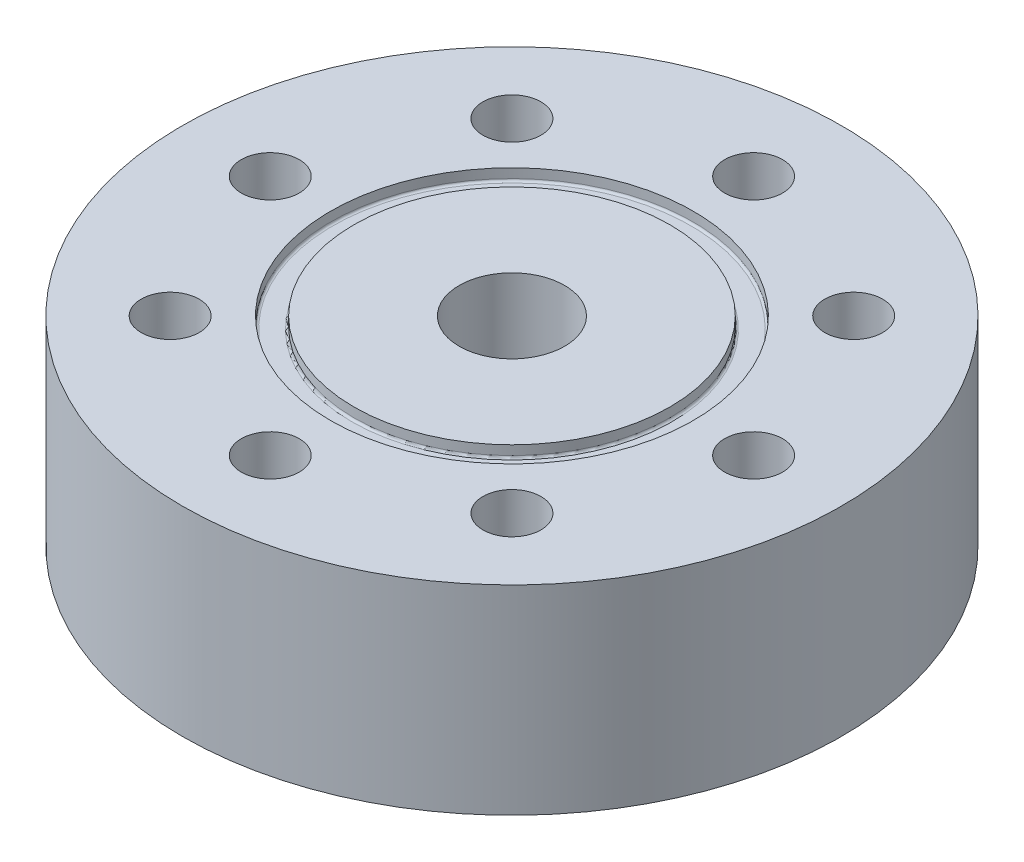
ISO-10303-21;
HEADER;
FILE_DESCRIPTION(('STEP AP214'),'2;1');
FILE_NAME('part.step','',(''),(''),'','','');
FILE_SCHEMA(('AUTOMOTIVE_DESIGN { 1 0 10303 214 1 1 1 1 }'));
ENDSEC;
DATA;
#1=APPLICATION_CONTEXT('core data for automotive mechanical design processes');
#2=APPLICATION_PROTOCOL_DEFINITION('international standard','automotive_design',2000,#1);
#3=PRODUCT_CONTEXT('',#1,'mechanical');
#4=PRODUCT('Part','Part','',(#3));
#5=PRODUCT_RELATED_PRODUCT_CATEGORY('part','',(#4));
#6=PRODUCT_DEFINITION_FORMATION('','',#4);
#7=PRODUCT_DEFINITION_CONTEXT('part definition',#1,'design');
#8=PRODUCT_DEFINITION('design','',#6,#7);
#9=PRODUCT_DEFINITION_SHAPE('','',#8);
#10=(LENGTH_UNIT() NAMED_UNIT(*) SI_UNIT(.MILLI.,.METRE.));
#11=(NAMED_UNIT(*) PLANE_ANGLE_UNIT() SI_UNIT($,.RADIAN.));
#12=(NAMED_UNIT(*) SI_UNIT($,.STERADIAN.) SOLID_ANGLE_UNIT());
#13=UNCERTAINTY_MEASURE_WITH_UNIT(LENGTH_MEASURE(1.E-05),#10,'distance_accuracy_value','');
#14=(GEOMETRIC_REPRESENTATION_CONTEXT(3) GLOBAL_UNCERTAINTY_ASSIGNED_CONTEXT((#13)) GLOBAL_UNIT_ASSIGNED_CONTEXT((#10,
#11,#12)) REPRESENTATION_CONTEXT('',''));
#15=CARTESIAN_POINT('',(0.,0.,0.));
#16=DIRECTION('',(0.,0.,1.));
#17=DIRECTION('',(1.,0.,0.));
#18=AXIS2_PLACEMENT_3D('',#15,#16,#17);
#19=CARTESIAN_POINT('',(0.,22.7,0.));
#20=DIRECTION('',(0.,-1.,0.));
#21=DIRECTION('',(0.,0.,-1.));
#22=AXIS2_PLACEMENT_3D('',#19,#20,#21);
#23=CYLINDRICAL_SURFACE('',#22,37.5);
#24=CARTESIAN_POINT('',(0.,22.7,0.));
#25=DIRECTION('',(0.,1.,0.));
#26=DIRECTION('',(0.,0.,1.));
#27=AXIS2_PLACEMENT_3D('',#24,#25,#26);
#28=CIRCLE('',#27,37.5);
#29=CARTESIAN_POINT('',(0.,22.7,37.5));
#30=VERTEX_POINT('',#29);
#31=EDGE_CURVE('E60',#30,#30,#28,.T.);
#32=ORIENTED_EDGE('',*,*,#31,.F.);
#33=EDGE_LOOP('',(#32));
#34=FACE_BOUND('',#33,.T.);
#35=CARTESIAN_POINT('',(0.,0.,0.));
#36=DIRECTION('',(0.,1.,0.));
#37=DIRECTION('',(0.,0.,1.));
#38=AXIS2_PLACEMENT_3D('',#35,#36,#37);
#39=CIRCLE('',#38,37.5);
#40=CARTESIAN_POINT('',(0.,0.,37.5));
#41=VERTEX_POINT('',#40);
#42=EDGE_CURVE('E61',#41,#41,#39,.T.);
#43=ORIENTED_EDGE('',*,*,#42,.T.);
#44=EDGE_LOOP('',(#43));
#45=FACE_BOUND('',#44,.T.);
#46=ADVANCED_FACE('F36',(#34,#45),#23,.T.);
#47=CARTESIAN_POINT('',(0.,22.7,0.));
#48=DIRECTION('',(0.,1.,0.));
#49=DIRECTION('',(0.,0.,1.));
#50=AXIS2_PLACEMENT_3D('',#47,#48,#49);
#51=PLANE('',#50);
#52=CARTESIAN_POINT('',(0.,22.7,0.));
#53=DIRECTION('',(0.,1.,0.));
#54=DIRECTION('',(0.,0.,1.));
#55=AXIS2_PLACEMENT_3D('',#52,#53,#54);
#56=CIRCLE('',#55,20.6375);
#57=CARTESIAN_POINT('',(0.,22.7,20.6375));
#58=VERTEX_POINT('',#57);
#59=EDGE_CURVE('E82',#58,#58,#56,.T.);
#60=ORIENTED_EDGE('',*,*,#59,.F.);
#61=EDGE_LOOP('',(#60));
#62=FACE_BOUND('',#61,.T.);
#63=CARTESIAN_POINT('',(-27.5,22.7,0.));
#64=DIRECTION('',(0.,-1.,0.));
#65=DIRECTION('',(0.,0.,-1.));
#66=AXIS2_PLACEMENT_3D('',#63,#64,#65);
#67=CIRCLE('',#66,3.3);
#68=CARTESIAN_POINT('',(-27.5,22.7,-3.3));
#69=VERTEX_POINT('',#68);
#70=EDGE_CURVE('E73',#69,#69,#67,.T.);
#71=ORIENTED_EDGE('',*,*,#70,.T.);
#72=EDGE_LOOP('',(#71));
#73=FACE_BOUND('',#72,.T.);
#74=CARTESIAN_POINT('',(-19.44543648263,22.7,19.4454364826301));
#75=DIRECTION('',(0.,-1.,0.));
#76=DIRECTION('',(0.,0.,-1.));
#77=AXIS2_PLACEMENT_3D('',#74,#75,#76);
#78=CIRCLE('',#77,3.30000000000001);
#79=CARTESIAN_POINT('',(-19.44543648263,22.7,16.1454364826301));
#80=VERTEX_POINT('',#79);
#81=EDGE_CURVE('E130',#80,#80,#78,.T.);
#82=ORIENTED_EDGE('',*,*,#81,.T.);
#83=EDGE_LOOP('',(#82));
#84=FACE_BOUND('',#83,.T.);
#85=CARTESIAN_POINT('',(0.,22.7,27.5));
#86=DIRECTION('',(0.,-1.,0.));
#87=DIRECTION('',(0.,0.,-1.));
#88=AXIS2_PLACEMENT_3D('',#85,#86,#87);
#89=CIRCLE('',#88,3.3);
#90=CARTESIAN_POINT('',(0.,22.7,24.2));
#91=VERTEX_POINT('',#90);
#92=EDGE_CURVE('E122',#91,#91,#89,.T.);
#93=ORIENTED_EDGE('',*,*,#92,.T.);
#94=EDGE_LOOP('',(#93));
#95=FACE_BOUND('',#94,.T.);
#96=CARTESIAN_POINT('',(19.4454364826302,22.7,19.44543648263));
#97=DIRECTION('',(0.,-1.,0.));
#98=DIRECTION('',(0.,0.,-1.));
#99=AXIS2_PLACEMENT_3D('',#96,#97,#98);
#100=CIRCLE('',#99,3.3);
#101=CARTESIAN_POINT('',(19.4454364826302,22.7,16.14543648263));
#102=VERTEX_POINT('',#101);
#103=EDGE_CURVE('E114',#102,#102,#100,.T.);
#104=ORIENTED_EDGE('',*,*,#103,.T.);
#105=EDGE_LOOP('',(#104));
#106=FACE_BOUND('',#105,.T.);
#107=CARTESIAN_POINT('',(27.5,22.7,-1.92031473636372E-13));
#108=DIRECTION('',(0.,-1.,0.));
#109=DIRECTION('',(0.,0.,-1.));
#110=AXIS2_PLACEMENT_3D('',#107,#108,#109);
#111=CIRCLE('',#110,3.3);
#112=CARTESIAN_POINT('',(27.5,22.7,-3.30000000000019));
#113=VERTEX_POINT('',#112);
#114=EDGE_CURVE('E106',#113,#113,#111,.T.);
#115=ORIENTED_EDGE('',*,*,#114,.T.);
#116=EDGE_LOOP('',(#115));
#117=FACE_BOUND('',#116,.T.);
#118=CARTESIAN_POINT('',(19.4454364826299,22.7,-19.4454364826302));
#119=DIRECTION('',(0.,-1.,0.));
#120=DIRECTION('',(0.,0.,-1.));
#121=AXIS2_PLACEMENT_3D('',#118,#119,#120);
#122=CIRCLE('',#121,3.3);
#123=CARTESIAN_POINT('',(19.4454364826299,22.7,-22.7454364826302));
#124=VERTEX_POINT('',#123);
#125=EDGE_CURVE('E98',#124,#124,#122,.T.);
#126=ORIENTED_EDGE('',*,*,#125,.T.);
#127=EDGE_LOOP('',(#126));
#128=FACE_BOUND('',#127,.T.);
#129=CARTESIAN_POINT('',(-2.88047210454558E-13,22.7,-27.5));
#130=DIRECTION('',(0.,-1.,0.));
#131=DIRECTION('',(0.,0.,-1.));
#132=AXIS2_PLACEMENT_3D('',#129,#130,#131);
#133=CIRCLE('',#132,3.3);
#134=CARTESIAN_POINT('',(-2.88047210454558E-13,22.7,-30.8));
#135=VERTEX_POINT('',#134);
#136=EDGE_CURVE('E90',#135,#135,#133,.T.);
#137=ORIENTED_EDGE('',*,*,#136,.T.);
#138=EDGE_LOOP('',(#137));
#139=FACE_BOUND('',#138,.T.);
#140=CARTESIAN_POINT('',(-19.4454364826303,22.7,-19.4454364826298));
#141=DIRECTION('',(0.,-1.,0.));
#142=DIRECTION('',(0.,0.,-1.));
#143=AXIS2_PLACEMENT_3D('',#140,#141,#142);
#144=CIRCLE('',#143,3.3);
#145=CARTESIAN_POINT('',(-19.4454364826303,22.7,-22.7454364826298));
#146=VERTEX_POINT('',#145);
#147=EDGE_CURVE('E81',#146,#146,#144,.T.);
#148=ORIENTED_EDGE('',*,*,#147,.T.);
#149=EDGE_LOOP('',(#148));
#150=FACE_BOUND('',#149,.T.);
#151=ORIENTED_EDGE('',*,*,#31,.T.);
#152=EDGE_LOOP('',(#151));
#153=FACE_BOUND('',#152,.T.);
#154=ADVANCED_FACE('F172',(#62,#73,#84,#95,#106,#117,#128,#139,#150,#153),#51,.T.);
#155=CARTESIAN_POINT('',(0.,0.,0.));
#156=DIRECTION('',(0.,1.,0.));
#157=DIRECTION('',(0.,0.,1.));
#158=AXIS2_PLACEMENT_3D('',#155,#156,#157);
#159=PLANE('',#158);
#160=CARTESIAN_POINT('',(-27.5,0.,0.));
#161=DIRECTION('',(0.,-1.,0.));
#162=DIRECTION('',(0.,0.,-1.));
#163=AXIS2_PLACEMENT_3D('',#160,#161,#162);
#164=CIRCLE('',#163,3.3);
#165=CARTESIAN_POINT('',(-27.5,0.,-3.3));
#166=VERTEX_POINT('',#165);
#167=EDGE_CURVE('E134',#166,#166,#164,.T.);
#168=ORIENTED_EDGE('',*,*,#167,.F.);
#169=EDGE_LOOP('',(#168));
#170=FACE_BOUND('',#169,.T.);
#171=CARTESIAN_POINT('',(-19.44543648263,0.,19.4454364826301));
#172=DIRECTION('',(0.,-1.,0.));
#173=DIRECTION('',(0.,0.,-1.));
#174=AXIS2_PLACEMENT_3D('',#171,#172,#173);
#175=CIRCLE('',#174,3.30000000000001);
#176=CARTESIAN_POINT('',(-19.44543648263,0.,16.1454364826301));
#177=VERTEX_POINT('',#176);
#178=EDGE_CURVE('E126',#177,#177,#175,.T.);
#179=ORIENTED_EDGE('',*,*,#178,.F.);
#180=EDGE_LOOP('',(#179));
#181=FACE_BOUND('',#180,.T.);
#182=CARTESIAN_POINT('',(0.,0.,27.5));
#183=DIRECTION('',(0.,-1.,0.));
#184=DIRECTION('',(0.,0.,-1.));
#185=AXIS2_PLACEMENT_3D('',#182,#183,#184);
#186=CIRCLE('',#185,3.3);
#187=CARTESIAN_POINT('',(0.,0.,24.2));
#188=VERTEX_POINT('',#187);
#189=EDGE_CURVE('E118',#188,#188,#186,.T.);
#190=ORIENTED_EDGE('',*,*,#189,.F.);
#191=EDGE_LOOP('',(#190));
#192=FACE_BOUND('',#191,.T.);
#193=CARTESIAN_POINT('',(19.4454364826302,0.,19.44543648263));
#194=DIRECTION('',(0.,-1.,0.));
#195=DIRECTION('',(0.,0.,-1.));
#196=AXIS2_PLACEMENT_3D('',#193,#194,#195);
#197=CIRCLE('',#196,3.3);
#198=CARTESIAN_POINT('',(19.4454364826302,0.,16.14543648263));
#199=VERTEX_POINT('',#198);
#200=EDGE_CURVE('E110',#199,#199,#197,.T.);
#201=ORIENTED_EDGE('',*,*,#200,.F.);
#202=EDGE_LOOP('',(#201));
#203=FACE_BOUND('',#202,.T.);
#204=CARTESIAN_POINT('',(27.5,0.,-1.92031473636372E-13));
#205=DIRECTION('',(0.,-1.,0.));
#206=DIRECTION('',(0.,0.,-1.));
#207=AXIS2_PLACEMENT_3D('',#204,#205,#206);
#208=CIRCLE('',#207,3.3);
#209=CARTESIAN_POINT('',(27.5,0.,-3.30000000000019));
#210=VERTEX_POINT('',#209);
#211=EDGE_CURVE('E102',#210,#210,#208,.T.);
#212=ORIENTED_EDGE('',*,*,#211,.F.);
#213=EDGE_LOOP('',(#212));
#214=FACE_BOUND('',#213,.T.);
#215=CARTESIAN_POINT('',(19.4454364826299,0.,-19.4454364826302));
#216=DIRECTION('',(0.,-1.,0.));
#217=DIRECTION('',(0.,0.,-1.));
#218=AXIS2_PLACEMENT_3D('',#215,#216,#217);
#219=CIRCLE('',#218,3.3);
#220=CARTESIAN_POINT('',(19.4454364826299,0.,-22.7454364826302));
#221=VERTEX_POINT('',#220);
#222=EDGE_CURVE('E94',#221,#221,#219,.T.);
#223=ORIENTED_EDGE('',*,*,#222,.F.);
#224=EDGE_LOOP('',(#223));
#225=FACE_BOUND('',#224,.T.);
#226=CARTESIAN_POINT('',(-2.88047210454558E-13,0.,-27.5));
#227=DIRECTION('',(0.,-1.,0.));
#228=DIRECTION('',(0.,0.,-1.));
#229=AXIS2_PLACEMENT_3D('',#226,#227,#228);
#230=CIRCLE('',#229,3.3);
#231=CARTESIAN_POINT('',(-2.88047210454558E-13,0.,-30.8));
#232=VERTEX_POINT('',#231);
#233=EDGE_CURVE('E86',#232,#232,#230,.T.);
#234=ORIENTED_EDGE('',*,*,#233,.F.);
#235=EDGE_LOOP('',(#234));
#236=FACE_BOUND('',#235,.T.);
#237=CARTESIAN_POINT('',(-19.4454364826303,0.,-19.4454364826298));
#238=DIRECTION('',(0.,-1.,0.));
#239=DIRECTION('',(0.,0.,-1.));
#240=AXIS2_PLACEMENT_3D('',#237,#238,#239);
#241=CIRCLE('',#240,3.3);
#242=CARTESIAN_POINT('',(-19.4454364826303,0.,-22.7454364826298));
#243=VERTEX_POINT('',#242);
#244=EDGE_CURVE('E77',#243,#243,#241,.T.);
#245=ORIENTED_EDGE('',*,*,#244,.F.);
#246=EDGE_LOOP('',(#245));
#247=FACE_BOUND('',#246,.T.);
#248=CARTESIAN_POINT('',(0.,0.,0.));
#249=DIRECTION('',(0.,-1.,0.));
#250=DIRECTION('',(0.,0.,-1.));
#251=AXIS2_PLACEMENT_3D('',#248,#249,#250);
#252=CIRCLE('',#251,8.93);
#253=CARTESIAN_POINT('',(0.,0.,-8.93));
#254=VERTEX_POINT('',#253);
#255=EDGE_CURVE('E69',#254,#254,#252,.T.);
#256=ORIENTED_EDGE('',*,*,#255,.F.);
#257=EDGE_LOOP('',(#256));
#258=FACE_BOUND('',#257,.T.);
#259=ORIENTED_EDGE('',*,*,#42,.F.);
#260=EDGE_LOOP('',(#259));
#261=FACE_BOUND('',#260,.T.);
#262=ADVANCED_FACE('F192',(#170,#181,#192,#203,#214,#225,#236,#247,#258,#261),#159,.F.);
#263=CARTESIAN_POINT('',(0.,12.7,0.));
#264=DIRECTION('',(0.,-1.,0.));
#265=DIRECTION('',(0.,0.,-1.));
#266=AXIS2_PLACEMENT_3D('',#263,#264,#265);
#267=CYLINDRICAL_SURFACE('',#266,8.93);
#268=CARTESIAN_POINT('',(0.,12.7,0.));
#269=DIRECTION('',(0.,-1.,0.));
#270=DIRECTION('',(0.,0.,-1.));
#271=AXIS2_PLACEMENT_3D('',#268,#269,#270);
#272=CIRCLE('',#271,8.93);
#273=CARTESIAN_POINT('',(0.,12.7,-8.93));
#274=VERTEX_POINT('',#273);
#275=EDGE_CURVE('E65',#274,#274,#272,.T.);
#276=ORIENTED_EDGE('',*,*,#275,.F.);
#277=EDGE_LOOP('',(#276));
#278=FACE_BOUND('',#277,.T.);
#279=ORIENTED_EDGE('',*,*,#255,.T.);
#280=EDGE_LOOP('',(#279));
#281=FACE_BOUND('',#280,.T.);
#282=ADVANCED_FACE('F228',(#278,#281),#267,.F.);
#283=CARTESIAN_POINT('',(0.,12.7,0.));
#284=DIRECTION('',(0.,-1.,0.));
#285=DIRECTION('',(0.,0.,-1.));
#286=AXIS2_PLACEMENT_3D('',#283,#284,#285);
#287=PLANE('',#286);
#288=CARTESIAN_POINT('',(0.,12.7,0.));
#289=DIRECTION('',(0.,1.,0.));
#290=DIRECTION('',(0.,0.,1.));
#291=AXIS2_PLACEMENT_3D('',#288,#289,#290);
#292=CIRCLE('',#291,6.);
#293=CARTESIAN_POINT('',(0.,12.7,6.));
#294=VERTEX_POINT('',#293);
#295=EDGE_CURVE('E148',#294,#294,#292,.T.);
#296=ORIENTED_EDGE('',*,*,#295,.T.);
#297=EDGE_LOOP('',(#296));
#298=FACE_BOUND('',#297,.T.);
#299=ORIENTED_EDGE('',*,*,#275,.T.);
#300=EDGE_LOOP('',(#299));
#301=FACE_BOUND('',#300,.T.);
#302=ADVANCED_FACE('F157',(#298,#301),#287,.T.);
#303=CARTESIAN_POINT('',(-19.4454364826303,22.7,-19.4454364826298));
#304=DIRECTION('',(0.,-1.,0.));
#305=DIRECTION('',(0.,0.,-1.));
#306=AXIS2_PLACEMENT_3D('',#303,#304,#305);
#307=CYLINDRICAL_SURFACE('',#306,3.3);
#308=ORIENTED_EDGE('',*,*,#147,.F.);
#309=EDGE_LOOP('',(#308));
#310=FACE_BOUND('',#309,.T.);
#311=ORIENTED_EDGE('',*,*,#244,.T.);
#312=EDGE_LOOP('',(#311));
#313=FACE_BOUND('',#312,.T.);
#314=ADVANCED_FACE('F227',(#310,#313),#307,.F.);
#315=CARTESIAN_POINT('',(-2.88047210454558E-13,22.7,-27.5));
#316=DIRECTION('',(0.,-1.,0.));
#317=DIRECTION('',(0.,0.,-1.));
#318=AXIS2_PLACEMENT_3D('',#315,#316,#317);
#319=CYLINDRICAL_SURFACE('',#318,3.3);
#320=ORIENTED_EDGE('',*,*,#136,.F.);
#321=EDGE_LOOP('',(#320));
#322=FACE_BOUND('',#321,.T.);
#323=ORIENTED_EDGE('',*,*,#233,.T.);
#324=EDGE_LOOP('',(#323));
#325=FACE_BOUND('',#324,.T.);
#326=ADVANCED_FACE('F244',(#322,#325),#319,.F.);
#327=CARTESIAN_POINT('',(19.4454364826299,22.7,-19.4454364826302));
#328=DIRECTION('',(0.,-1.,0.));
#329=DIRECTION('',(0.,0.,-1.));
#330=AXIS2_PLACEMENT_3D('',#327,#328,#329);
#331=CYLINDRICAL_SURFACE('',#330,3.3);
#332=ORIENTED_EDGE('',*,*,#125,.F.);
#333=EDGE_LOOP('',(#332));
#334=FACE_BOUND('',#333,.T.);
#335=ORIENTED_EDGE('',*,*,#222,.T.);
#336=EDGE_LOOP('',(#335));
#337=FACE_BOUND('',#336,.T.);
#338=ADVANCED_FACE('F252',(#334,#337),#331,.F.);
#339=CARTESIAN_POINT('',(27.5,22.7,-1.92031473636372E-13));
#340=DIRECTION('',(0.,-1.,0.));
#341=DIRECTION('',(0.,0.,-1.));
#342=AXIS2_PLACEMENT_3D('',#339,#340,#341);
#343=CYLINDRICAL_SURFACE('',#342,3.3);
#344=ORIENTED_EDGE('',*,*,#114,.F.);
#345=EDGE_LOOP('',(#344));
#346=FACE_BOUND('',#345,.T.);
#347=ORIENTED_EDGE('',*,*,#211,.T.);
#348=EDGE_LOOP('',(#347));
#349=FACE_BOUND('',#348,.T.);
#350=ADVANCED_FACE('F260',(#346,#349),#343,.F.);
#351=CARTESIAN_POINT('',(19.4454364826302,22.7,19.44543648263));
#352=DIRECTION('',(0.,-1.,0.));
#353=DIRECTION('',(0.,0.,-1.));
#354=AXIS2_PLACEMENT_3D('',#351,#352,#353);
#355=CYLINDRICAL_SURFACE('',#354,3.3);
#356=ORIENTED_EDGE('',*,*,#103,.F.);
#357=EDGE_LOOP('',(#356));
#358=FACE_BOUND('',#357,.T.);
#359=ORIENTED_EDGE('',*,*,#200,.T.);
#360=EDGE_LOOP('',(#359));
#361=FACE_BOUND('',#360,.T.);
#362=ADVANCED_FACE('F268',(#358,#361),#355,.F.);
#363=CARTESIAN_POINT('',(0.,22.7,27.5));
#364=DIRECTION('',(0.,-1.,0.));
#365=DIRECTION('',(0.,0.,-1.));
#366=AXIS2_PLACEMENT_3D('',#363,#364,#365);
#367=CYLINDRICAL_SURFACE('',#366,3.3);
#368=ORIENTED_EDGE('',*,*,#92,.F.);
#369=EDGE_LOOP('',(#368));
#370=FACE_BOUND('',#369,.T.);
#371=ORIENTED_EDGE('',*,*,#189,.T.);
#372=EDGE_LOOP('',(#371));
#373=FACE_BOUND('',#372,.T.);
#374=ADVANCED_FACE('F276',(#370,#373),#367,.F.);
#375=CARTESIAN_POINT('',(-19.44543648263,22.7,19.4454364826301));
#376=DIRECTION('',(0.,-1.,0.));
#377=DIRECTION('',(0.,0.,-1.));
#378=AXIS2_PLACEMENT_3D('',#375,#376,#377);
#379=CYLINDRICAL_SURFACE('',#378,3.30000000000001);
#380=ORIENTED_EDGE('',*,*,#81,.F.);
#381=EDGE_LOOP('',(#380));
#382=FACE_BOUND('',#381,.T.);
#383=ORIENTED_EDGE('',*,*,#178,.T.);
#384=EDGE_LOOP('',(#383));
#385=FACE_BOUND('',#384,.T.);
#386=ADVANCED_FACE('F284',(#382,#385),#379,.F.);
#387=CARTESIAN_POINT('',(-27.5,22.7,0.));
#388=DIRECTION('',(0.,-1.,0.));
#389=DIRECTION('',(0.,0.,-1.));
#390=AXIS2_PLACEMENT_3D('',#387,#388,#389);
#391=CYLINDRICAL_SURFACE('',#390,3.3);
#392=ORIENTED_EDGE('',*,*,#70,.F.);
#393=EDGE_LOOP('',(#392));
#394=FACE_BOUND('',#393,.T.);
#395=ORIENTED_EDGE('',*,*,#167,.T.);
#396=EDGE_LOOP('',(#395));
#397=FACE_BOUND('',#396,.T.);
#398=ADVANCED_FACE('F292',(#394,#397),#391,.F.);
#399=CARTESIAN_POINT('',(0.,21.3792,0.));
#400=DIRECTION('',(0.,1.,0.));
#401=DIRECTION('',(0.,0.,1.));
#402=AXIS2_PLACEMENT_3D('',#399,#400,#401);
#403=CYLINDRICAL_SURFACE('',#402,20.6375);
#404=CARTESIAN_POINT('',(0.,21.6332,0.));
#405=DIRECTION('',(0.,1.,0.));
#406=DIRECTION('',(0.,0.,1.));
#407=AXIS2_PLACEMENT_3D('',#404,#405,#406);
#408=CIRCLE('',#407,20.6375);
#409=CARTESIAN_POINT('',(0.,21.6332,20.6375));
#410=VERTEX_POINT('',#409);
#411=EDGE_CURVE('E10',#410,#410,#408,.F.);
#412=ORIENTED_EDGE('',*,*,#411,.T.);
#413=EDGE_LOOP('',(#412));
#414=FACE_BOUND('',#413,.T.);
#415=ORIENTED_EDGE('',*,*,#59,.T.);
#416=EDGE_LOOP('',(#415));
#417=FACE_BOUND('',#416,.T.);
#418=ADVANCED_FACE('F183',(#414,#417),#403,.F.);
#419=CARTESIAN_POINT('',(0.,21.3792,0.));
#420=DIRECTION('',(0.,1.,0.));
#421=DIRECTION('',(0.,0.,1.));
#422=AXIS2_PLACEMENT_3D('',#419,#420,#421);
#423=PLANE('',#422);
#424=CARTESIAN_POINT('',(0.,21.3792,0.));
#425=DIRECTION('',(0.,1.,0.));
#426=DIRECTION('',(0.,0.,1.));
#427=AXIS2_PLACEMENT_3D('',#424,#425,#426);
#428=CIRCLE('',#427,18.2245);
#429=CARTESIAN_POINT('',(0.,21.3792,18.2245));
#430=VERTEX_POINT('',#429);
#431=EDGE_CURVE('E44',#430,#430,#428,.F.);
#432=ORIENTED_EDGE('',*,*,#431,.T.);
#433=EDGE_LOOP('',(#432));
#434=FACE_BOUND('',#433,.T.);
#435=CARTESIAN_POINT('',(0.,21.3792,0.));
#436=DIRECTION('',(0.,1.,0.));
#437=DIRECTION('',(0.,0.,1.));
#438=AXIS2_PLACEMENT_3D('',#435,#436,#437);
#439=CIRCLE('',#438,20.3835);
#440=CARTESIAN_POINT('',(0.,21.3792,20.3835));
#441=VERTEX_POINT('',#440);
#442=EDGE_CURVE('E49',#441,#441,#439,.T.);
#443=ORIENTED_EDGE('',*,*,#442,.T.);
#444=EDGE_LOOP('',(#443));
#445=FACE_BOUND('',#444,.T.);
#446=ADVANCED_FACE('F176',(#434,#445),#423,.T.);
#447=CARTESIAN_POINT('',(0.,21.3792,0.));
#448=DIRECTION('',(0.,1.,0.));
#449=DIRECTION('',(0.,0.,1.));
#450=AXIS2_PLACEMENT_3D('',#447,#448,#449);
#451=CYLINDRICAL_SURFACE('',#450,17.9705);
#452=CARTESIAN_POINT('',(0.,21.6332,0.));
#453=DIRECTION('',(0.,1.,0.));
#454=DIRECTION('',(0.,0.,1.));
#455=AXIS2_PLACEMENT_3D('',#452,#453,#454);
#456=CIRCLE('',#455,17.9705);
#457=CARTESIAN_POINT('',(0.,21.6332,17.9705));
#458=VERTEX_POINT('',#457);
#459=EDGE_CURVE('E54',#458,#458,#456,.T.);
#460=ORIENTED_EDGE('',*,*,#459,.T.);
#461=EDGE_LOOP('',(#460));
#462=FACE_BOUND('',#461,.T.);
#463=CARTESIAN_POINT('',(0.,22.7,0.));
#464=DIRECTION('',(0.,1.,0.));
#465=DIRECTION('',(0.,0.,1.));
#466=AXIS2_PLACEMENT_3D('',#463,#464,#465);
#467=CIRCLE('',#466,17.9705);
#468=CARTESIAN_POINT('',(0.,22.7,17.9705));
#469=VERTEX_POINT('',#468);
#470=EDGE_CURVE('E144',#469,#469,#467,.T.);
#471=ORIENTED_EDGE('',*,*,#470,.F.);
#472=EDGE_LOOP('',(#471));
#473=FACE_BOUND('',#472,.T.);
#474=ADVANCED_FACE('F170',(#462,#473),#451,.T.);
#475=CARTESIAN_POINT('',(0.,22.7,0.));
#476=DIRECTION('',(0.,1.,0.));
#477=DIRECTION('',(0.,0.,1.));
#478=AXIS2_PLACEMENT_3D('',#475,#476,#477);
#479=CIRCLE('',#478,6.);
#480=CARTESIAN_POINT('',(0.,22.7,6.));
#481=VERTEX_POINT('',#480);
#482=EDGE_CURVE('E149',#481,#481,#479,.T.);
#483=ORIENTED_EDGE('',*,*,#482,.F.);
#484=EDGE_LOOP('',(#483));
#485=FACE_BOUND('',#484,.T.);
#486=ORIENTED_EDGE('',*,*,#470,.T.);
#487=EDGE_LOOP('',(#486));
#488=FACE_BOUND('',#487,.T.);
#489=ADVANCED_FACE('F166',(#485,#488),#51,.T.);
#490=CARTESIAN_POINT('',(0.,21.6332,0.));
#491=DIRECTION('',(0.,1.,0.));
#492=DIRECTION('',(0.,0.,1.));
#493=AXIS2_PLACEMENT_3D('',#490,#491,#492);
#494=TOROIDAL_SURFACE('',#493,18.2245,0.254);
#495=ORIENTED_EDGE('',*,*,#431,.F.);
#496=EDGE_LOOP('',(#495));
#497=FACE_BOUND('',#496,.T.);
#498=ORIENTED_EDGE('',*,*,#459,.F.);
#499=EDGE_LOOP('',(#498));
#500=FACE_BOUND('',#499,.T.);
#501=ADVANCED_FACE('F169',(#497,#500),#494,.F.);
#502=CARTESIAN_POINT('',(0.,21.6332,0.));
#503=DIRECTION('',(0.,1.,0.));
#504=DIRECTION('',(0.,0.,1.));
#505=AXIS2_PLACEMENT_3D('',#502,#503,#504);
#506=TOROIDAL_SURFACE('',#505,20.3835,0.254);
#507=ORIENTED_EDGE('',*,*,#411,.F.);
#508=EDGE_LOOP('',(#507));
#509=FACE_BOUND('',#508,.T.);
#510=ORIENTED_EDGE('',*,*,#442,.F.);
#511=EDGE_LOOP('',(#510));
#512=FACE_BOUND('',#511,.T.);
#513=ADVANCED_FACE('F38',(#509,#512),#506,.F.);
#514=CARTESIAN_POINT('',(0.,12.7,0.));
#515=DIRECTION('',(0.,1.,0.));
#516=DIRECTION('',(0.,0.,1.));
#517=AXIS2_PLACEMENT_3D('',#514,#515,#516);
#518=CYLINDRICAL_SURFACE('',#517,6.);
#519=ORIENTED_EDGE('',*,*,#295,.F.);
#520=EDGE_LOOP('',(#519));
#521=FACE_BOUND('',#520,.T.);
#522=ORIENTED_EDGE('',*,*,#482,.T.);
#523=EDGE_LOOP('',(#522));
#524=FACE_BOUND('',#523,.T.);
#525=ADVANCED_FACE('F160',(#521,#524),#518,.F.);
#526=CLOSED_SHELL('',(#46,#154,#262,#282,#302,#314,#326,#338,#350,#362,#374,#386,#398,#418,#446,
#474,#489,#501,#513,#525));
#527=MANIFOLD_SOLID_BREP('B2',#526);
#528=ADVANCED_BREP_SHAPE_REPRESENTATION('',(#18,#527),#14);
#529=SHAPE_DEFINITION_REPRESENTATION(#9,#528);
ENDSEC;
END-ISO-10303-21;
